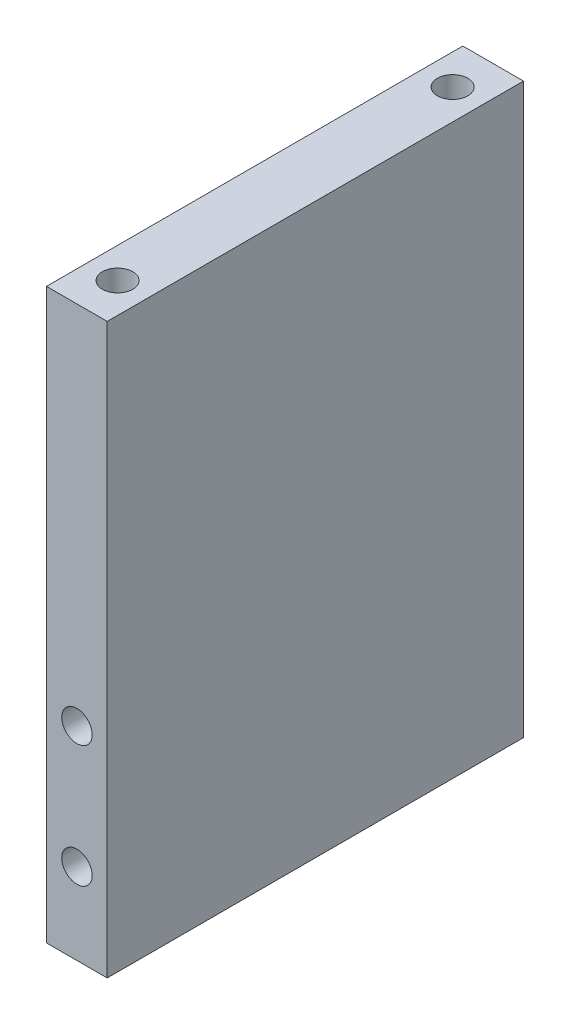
ISO-10303-21;
HEADER;
FILE_DESCRIPTION(('STEP AP214'),'2;1');
FILE_NAME('part.step','',(''),(''),'','','');
FILE_SCHEMA(('AUTOMOTIVE_DESIGN { 1 0 10303 214 1 1 1 1 }'));
ENDSEC;
DATA;
#1=APPLICATION_CONTEXT('core data for automotive mechanical design processes');
#2=APPLICATION_PROTOCOL_DEFINITION('international standard','automotive_design',2000,#1);
#3=PRODUCT_CONTEXT('',#1,'mechanical');
#4=PRODUCT('Part','Part','',(#3));
#5=PRODUCT_RELATED_PRODUCT_CATEGORY('part','',(#4));
#6=PRODUCT_DEFINITION_FORMATION('','',#4);
#7=PRODUCT_DEFINITION_CONTEXT('part definition',#1,'design');
#8=PRODUCT_DEFINITION('design','',#6,#7);
#9=PRODUCT_DEFINITION_SHAPE('','',#8);
#10=(LENGTH_UNIT() NAMED_UNIT(*) SI_UNIT(.MILLI.,.METRE.));
#11=(NAMED_UNIT(*) PLANE_ANGLE_UNIT() SI_UNIT($,.RADIAN.));
#12=(NAMED_UNIT(*) SI_UNIT($,.STERADIAN.) SOLID_ANGLE_UNIT());
#13=UNCERTAINTY_MEASURE_WITH_UNIT(LENGTH_MEASURE(1.E-05),#10,'distance_accuracy_value','');
#14=(GEOMETRIC_REPRESENTATION_CONTEXT(3) GLOBAL_UNCERTAINTY_ASSIGNED_CONTEXT((#13)) GLOBAL_UNIT_ASSIGNED_CONTEXT((#10,
#11,#12)) REPRESENTATION_CONTEXT('',''));
#15=CARTESIAN_POINT('',(0.,0.,0.));
#16=DIRECTION('',(0.,0.,1.));
#17=DIRECTION('',(1.,0.,0.));
#18=AXIS2_PLACEMENT_3D('',#15,#16,#17);
#19=CARTESIAN_POINT('',(0.,56.,0.));
#20=DIRECTION('',(0.,1.,0.));
#21=DIRECTION('',(0.,0.,1.));
#22=AXIS2_PLACEMENT_3D('',#19,#20,#21);
#23=PLANE('',#22);
#24=CARTESIAN_POINT('',(0.00999999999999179,56.,16.5));
#25=DIRECTION('',(0.,1.,0.));
#26=DIRECTION('',(0.,0.,1.));
#27=AXIS2_PLACEMENT_3D('',#24,#25,#26);
#28=CIRCLE('',#27,1.5);
#29=CARTESIAN_POINT('',(0.00999999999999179,56.,18.));
#30=VERTEX_POINT('',#29);
#31=EDGE_CURVE('E152',#30,#30,#28,.F.);
#32=ORIENTED_EDGE('',*,*,#31,.T.);
#33=EDGE_LOOP('',(#32));
#34=FACE_BOUND('',#33,.T.);
#35=DIRECTION('',(0.,0.,-1.));
#36=VECTOR('',#35,1.);
#37=CARTESIAN_POINT('',(-2.99,56.,0.));
#38=LINE('',#37,#36);
#39=CARTESIAN_POINT('',(-2.99,56.,20.5));
#40=VERTEX_POINT('',#39);
#41=CARTESIAN_POINT('',(-2.99,56.,-20.5));
#42=VERTEX_POINT('',#41);
#43=EDGE_CURVE('E120',#40,#42,#38,.T.);
#44=ORIENTED_EDGE('',*,*,#43,.F.);
#45=DIRECTION('',(1.,0.,0.));
#46=VECTOR('',#45,1.);
#47=CARTESIAN_POINT('',(0.,56.,20.5));
#48=LINE('',#47,#46);
#49=CARTESIAN_POINT('',(2.99,56.,20.5));
#50=VERTEX_POINT('',#49);
#51=EDGE_CURVE('E116',#40,#50,#48,.T.);
#52=ORIENTED_EDGE('',*,*,#51,.T.);
#53=DIRECTION('',(0.,0.,-1.));
#54=VECTOR('',#53,1.);
#55=CARTESIAN_POINT('',(2.99,56.,0.));
#56=LINE('',#55,#54);
#57=CARTESIAN_POINT('',(2.99,56.,-20.5));
#58=VERTEX_POINT('',#57);
#59=EDGE_CURVE('E108',#50,#58,#56,.T.);
#60=ORIENTED_EDGE('',*,*,#59,.T.);
#61=DIRECTION('',(1.,0.,0.));
#62=VECTOR('',#61,1.);
#63=CARTESIAN_POINT('',(0.,56.,-20.5));
#64=LINE('',#63,#62);
#65=EDGE_CURVE('E115',#42,#58,#64,.T.);
#66=ORIENTED_EDGE('',*,*,#65,.F.);
#67=EDGE_LOOP('',(#44,#52,#60,#66));
#68=FACE_BOUND('',#67,.T.);
#69=CARTESIAN_POINT('',(0.00999999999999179,56.,-16.5));
#70=DIRECTION('',(0.,1.,0.));
#71=DIRECTION('',(0.,0.,1.));
#72=AXIS2_PLACEMENT_3D('',#69,#70,#71);
#73=CIRCLE('',#72,1.5);
#74=CARTESIAN_POINT('',(0.00999999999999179,56.,-15.));
#75=VERTEX_POINT('',#74);
#76=EDGE_CURVE('E159',#75,#75,#73,.T.);
#77=ORIENTED_EDGE('',*,*,#76,.F.);
#78=EDGE_LOOP('',(#77));
#79=FACE_BOUND('',#78,.T.);
#80=ADVANCED_FACE('F65',(#34,#68,#79),#23,.T.);
#81=CARTESIAN_POINT('',(0.,0.,0.));
#82=DIRECTION('',(0.,1.,0.));
#83=DIRECTION('',(0.,0.,1.));
#84=AXIS2_PLACEMENT_3D('',#81,#82,#83);
#85=PLANE('',#84);
#86=CARTESIAN_POINT('',(0.00999999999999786,0.,16.5));
#87=DIRECTION('',(0.,1.,0.));
#88=DIRECTION('',(0.,0.,1.));
#89=AXIS2_PLACEMENT_3D('',#86,#87,#88);
#90=CIRCLE('',#89,1.5);
#91=CARTESIAN_POINT('',(0.00999999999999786,0.,18.));
#92=VERTEX_POINT('',#91);
#93=EDGE_CURVE('E140',#92,#92,#90,.F.);
#94=ORIENTED_EDGE('',*,*,#93,.F.);
#95=EDGE_LOOP('',(#94));
#96=FACE_BOUND('',#95,.T.);
#97=DIRECTION('',(0.,0.,-1.));
#98=VECTOR('',#97,1.);
#99=CARTESIAN_POINT('',(-2.99,0.,0.));
#100=LINE('',#99,#98);
#101=CARTESIAN_POINT('',(-2.99,0.,20.5));
#102=VERTEX_POINT('',#101);
#103=CARTESIAN_POINT('',(-2.99,0.,-20.5));
#104=VERTEX_POINT('',#103);
#105=EDGE_CURVE('E135',#102,#104,#100,.T.);
#106=ORIENTED_EDGE('',*,*,#105,.T.);
#107=DIRECTION('',(1.,0.,0.));
#108=VECTOR('',#107,1.);
#109=CARTESIAN_POINT('',(0.,0.,-20.5));
#110=LINE('',#109,#108);
#111=CARTESIAN_POINT('',(2.99,0.,-20.5));
#112=VERTEX_POINT('',#111);
#113=EDGE_CURVE('E129',#104,#112,#110,.T.);
#114=ORIENTED_EDGE('',*,*,#113,.T.);
#115=DIRECTION('',(0.,0.,-1.));
#116=VECTOR('',#115,1.);
#117=CARTESIAN_POINT('',(2.99,0.,0.));
#118=LINE('',#117,#116);
#119=CARTESIAN_POINT('',(2.99,0.,20.5));
#120=VERTEX_POINT('',#119);
#121=EDGE_CURVE('E132',#120,#112,#118,.T.);
#122=ORIENTED_EDGE('',*,*,#121,.F.);
#123=DIRECTION('',(1.,0.,0.));
#124=VECTOR('',#123,1.);
#125=CARTESIAN_POINT('',(0.,0.,20.5));
#126=LINE('',#125,#124);
#127=EDGE_CURVE('E125',#102,#120,#126,.T.);
#128=ORIENTED_EDGE('',*,*,#127,.F.);
#129=EDGE_LOOP('',(#106,#114,#122,#128));
#130=FACE_BOUND('',#129,.T.);
#131=CARTESIAN_POINT('',(0.00999999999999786,0.,-16.5));
#132=DIRECTION('',(0.,1.,0.));
#133=DIRECTION('',(0.,0.,1.));
#134=AXIS2_PLACEMENT_3D('',#131,#132,#133);
#135=CIRCLE('',#134,1.5);
#136=CARTESIAN_POINT('',(0.00999999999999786,0.,-15.));
#137=VERTEX_POINT('',#136);
#138=EDGE_CURVE('E147',#137,#137,#135,.T.);
#139=ORIENTED_EDGE('',*,*,#138,.T.);
#140=EDGE_LOOP('',(#139));
#141=FACE_BOUND('',#140,.T.);
#142=ADVANCED_FACE('F185',(#96,#130,#141),#85,.F.);
#143=CARTESIAN_POINT('',(0.,56.,20.5));
#144=DIRECTION('',(0.,0.,-1.));
#145=DIRECTION('',(-1.,0.,0.));
#146=AXIS2_PLACEMENT_3D('',#143,#144,#145);
#147=PLANE('',#146);
#148=CARTESIAN_POINT('',(0.00999999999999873,8.,20.5));
#149=DIRECTION('',(0.,0.,-1.));
#150=DIRECTION('',(-1.,0.,0.));
#151=AXIS2_PLACEMENT_3D('',#148,#149,#150);
#152=CIRCLE('',#151,1.5);
#153=CARTESIAN_POINT('',(-1.49,8.,20.5));
#154=VERTEX_POINT('',#153);
#155=EDGE_CURVE('E156',#154,#154,#152,.T.);
#156=ORIENTED_EDGE('',*,*,#155,.T.);
#157=EDGE_LOOP('',(#156));
#158=FACE_BOUND('',#157,.T.);
#159=CARTESIAN_POINT('',(0.00999999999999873,20.,20.5));
#160=DIRECTION('',(0.,0.,-1.));
#161=DIRECTION('',(-1.,0.,0.));
#162=AXIS2_PLACEMENT_3D('',#159,#160,#161);
#163=CIRCLE('',#162,1.5);
#164=CARTESIAN_POINT('',(-1.49,20.,20.5));
#165=VERTEX_POINT('',#164);
#166=EDGE_CURVE('E166',#165,#165,#163,.T.);
#167=ORIENTED_EDGE('',*,*,#166,.T.);
#168=EDGE_LOOP('',(#167));
#169=FACE_BOUND('',#168,.T.);
#170=ORIENTED_EDGE('',*,*,#127,.T.);
#171=DIRECTION('',(0.,-1.,0.));
#172=VECTOR('',#171,1.);
#173=CARTESIAN_POINT('',(2.99,56.,20.5));
#174=LINE('',#173,#172);
#175=EDGE_CURVE('E74',#50,#120,#174,.T.);
#176=ORIENTED_EDGE('',*,*,#175,.F.);
#177=ORIENTED_EDGE('',*,*,#51,.F.);
#178=DIRECTION('',(0.,-1.,0.));
#179=VECTOR('',#178,1.);
#180=CARTESIAN_POINT('',(-2.99,56.,20.5));
#181=LINE('',#180,#179);
#182=EDGE_CURVE('E12',#40,#102,#181,.T.);
#183=ORIENTED_EDGE('',*,*,#182,.T.);
#184=EDGE_LOOP('',(#170,#176,#177,#183));
#185=FACE_BOUND('',#184,.T.);
#186=ADVANCED_FACE('F123',(#158,#169,#185),#147,.F.);
#187=CARTESIAN_POINT('',(2.99,56.,0.));
#188=DIRECTION('',(-1.,0.,0.));
#189=DIRECTION('',(0.,0.,1.));
#190=AXIS2_PLACEMENT_3D('',#187,#188,#189);
#191=PLANE('',#190);
#192=ORIENTED_EDGE('',*,*,#121,.T.);
#193=DIRECTION('',(0.,-1.,0.));
#194=VECTOR('',#193,1.);
#195=CARTESIAN_POINT('',(2.99,56.,-20.5));
#196=LINE('',#195,#194);
#197=EDGE_CURVE('E96',#58,#112,#196,.T.);
#198=ORIENTED_EDGE('',*,*,#197,.F.);
#199=ORIENTED_EDGE('',*,*,#59,.F.);
#200=ORIENTED_EDGE('',*,*,#175,.T.);
#201=EDGE_LOOP('',(#192,#198,#199,#200));
#202=FACE_BOUND('',#201,.T.);
#203=ADVANCED_FACE('F110',(#202),#191,.F.);
#204=CARTESIAN_POINT('',(0.,56.,-20.5));
#205=DIRECTION('',(0.,0.,-1.));
#206=DIRECTION('',(-1.,0.,0.));
#207=AXIS2_PLACEMENT_3D('',#204,#205,#206);
#208=PLANE('',#207);
#209=CARTESIAN_POINT('',(0.00999999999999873,8.,-20.5));
#210=DIRECTION('',(0.,0.,-1.));
#211=DIRECTION('',(-1.,0.,0.));
#212=AXIS2_PLACEMENT_3D('',#209,#210,#211);
#213=CIRCLE('',#212,1.5);
#214=CARTESIAN_POINT('',(-1.49,8.,-20.5));
#215=VERTEX_POINT('',#214);
#216=EDGE_CURVE('E169',#215,#215,#213,.T.);
#217=ORIENTED_EDGE('',*,*,#216,.F.);
#218=EDGE_LOOP('',(#217));
#219=FACE_BOUND('',#218,.T.);
#220=CARTESIAN_POINT('',(0.00999999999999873,20.,-20.5));
#221=DIRECTION('',(0.,0.,-1.));
#222=DIRECTION('',(-1.,0.,0.));
#223=AXIS2_PLACEMENT_3D('',#220,#221,#222);
#224=CIRCLE('',#223,1.5);
#225=CARTESIAN_POINT('',(-1.49,20.,-20.5));
#226=VERTEX_POINT('',#225);
#227=EDGE_CURVE('E170',#226,#226,#224,.T.);
#228=ORIENTED_EDGE('',*,*,#227,.F.);
#229=EDGE_LOOP('',(#228));
#230=FACE_BOUND('',#229,.T.);
#231=ORIENTED_EDGE('',*,*,#113,.F.);
#232=DIRECTION('',(0.,-1.,0.));
#233=VECTOR('',#232,1.);
#234=CARTESIAN_POINT('',(-2.99,56.,-20.5));
#235=LINE('',#234,#233);
#236=EDGE_CURVE('E82',#42,#104,#235,.T.);
#237=ORIENTED_EDGE('',*,*,#236,.F.);
#238=ORIENTED_EDGE('',*,*,#65,.T.);
#239=ORIENTED_EDGE('',*,*,#197,.T.);
#240=EDGE_LOOP('',(#231,#237,#238,#239));
#241=FACE_BOUND('',#240,.T.);
#242=ADVANCED_FACE('F179',(#219,#230,#241),#208,.T.);
#243=CARTESIAN_POINT('',(-2.99,56.,0.));
#244=DIRECTION('',(-1.,0.,0.));
#245=DIRECTION('',(0.,0.,1.));
#246=AXIS2_PLACEMENT_3D('',#243,#244,#245);
#247=PLANE('',#246);
#248=ORIENTED_EDGE('',*,*,#105,.F.);
#249=ORIENTED_EDGE('',*,*,#182,.F.);
#250=ORIENTED_EDGE('',*,*,#43,.T.);
#251=ORIENTED_EDGE('',*,*,#236,.T.);
#252=EDGE_LOOP('',(#248,#249,#250,#251));
#253=FACE_BOUND('',#252,.T.);
#254=ADVANCED_FACE('F67',(#253),#247,.T.);
#255=CARTESIAN_POINT('',(0.00999999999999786,6.,16.5));
#256=DIRECTION('',(0.,-1.,0.));
#257=DIRECTION('',(0.,0.,-1.));
#258=AXIS2_PLACEMENT_3D('',#255,#256,#257);
#259=CYLINDRICAL_SURFACE('',#258,1.5);
#260=CARTESIAN_POINT('',(0.00999999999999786,6.,16.5));
#261=DIRECTION('',(0.,1.,0.));
#262=DIRECTION('',(0.,0.,1.));
#263=AXIS2_PLACEMENT_3D('',#260,#261,#262);
#264=CIRCLE('',#263,1.5);
#265=CARTESIAN_POINT('',(0.00999999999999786,6.,18.));
#266=VERTEX_POINT('',#265);
#267=EDGE_CURVE('E143',#266,#266,#264,.F.);
#268=ORIENTED_EDGE('',*,*,#267,.F.);
#269=EDGE_LOOP('',(#268));
#270=FACE_BOUND('',#269,.T.);
#271=ORIENTED_EDGE('',*,*,#93,.T.);
#272=EDGE_LOOP('',(#271));
#273=FACE_BOUND('',#272,.T.);
#274=ADVANCED_FACE('F188',(#270,#273),#259,.F.);
#275=CARTESIAN_POINT('',(0.,6.,0.));
#276=DIRECTION('',(0.,1.,0.));
#277=DIRECTION('',(0.,0.,1.));
#278=AXIS2_PLACEMENT_3D('',#275,#276,#277);
#279=PLANE('',#278);
#280=ORIENTED_EDGE('',*,*,#267,.T.);
#281=EDGE_LOOP('',(#280));
#282=FACE_BOUND('',#281,.T.);
#283=ADVANCED_FACE('F192',(#282),#279,.F.);
#284=CARTESIAN_POINT('',(0.00999999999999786,6.,-16.5));
#285=DIRECTION('',(0.,-1.,0.));
#286=DIRECTION('',(0.,0.,-1.));
#287=AXIS2_PLACEMENT_3D('',#284,#285,#286);
#288=CYLINDRICAL_SURFACE('',#287,1.5);
#289=CARTESIAN_POINT('',(0.00999999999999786,6.,-16.5));
#290=DIRECTION('',(0.,1.,0.));
#291=DIRECTION('',(0.,0.,1.));
#292=AXIS2_PLACEMENT_3D('',#289,#290,#291);
#293=CIRCLE('',#292,1.5);
#294=CARTESIAN_POINT('',(0.00999999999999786,6.,-15.));
#295=VERTEX_POINT('',#294);
#296=EDGE_CURVE('E137',#295,#295,#293,.T.);
#297=ORIENTED_EDGE('',*,*,#296,.T.);
#298=EDGE_LOOP('',(#297));
#299=FACE_BOUND('',#298,.T.);
#300=ORIENTED_EDGE('',*,*,#138,.F.);
#301=EDGE_LOOP('',(#300));
#302=FACE_BOUND('',#301,.T.);
#303=ADVANCED_FACE('F242',(#299,#302),#288,.F.);
#304=CARTESIAN_POINT('',(0.,6.,0.));
#305=DIRECTION('',(0.,1.,0.));
#306=DIRECTION('',(0.,0.,1.));
#307=AXIS2_PLACEMENT_3D('',#304,#305,#306);
#308=PLANE('',#307);
#309=ORIENTED_EDGE('',*,*,#296,.F.);
#310=EDGE_LOOP('',(#309));
#311=FACE_BOUND('',#310,.T.);
#312=ADVANCED_FACE('F238',(#311),#308,.F.);
#313=CARTESIAN_POINT('',(0.00999999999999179,50.,16.5));
#314=DIRECTION('',(0.,1.,0.));
#315=DIRECTION('',(0.,0.,1.));
#316=AXIS2_PLACEMENT_3D('',#313,#314,#315);
#317=CYLINDRICAL_SURFACE('',#316,1.5);
#318=CARTESIAN_POINT('',(0.00999999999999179,50.,16.5));
#319=DIRECTION('',(0.,1.,0.));
#320=DIRECTION('',(0.,0.,1.));
#321=AXIS2_PLACEMENT_3D('',#318,#319,#320);
#322=CIRCLE('',#321,1.5);
#323=CARTESIAN_POINT('',(0.00999999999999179,50.,18.));
#324=VERTEX_POINT('',#323);
#325=EDGE_CURVE('E155',#324,#324,#322,.F.);
#326=ORIENTED_EDGE('',*,*,#325,.T.);
#327=EDGE_LOOP('',(#326));
#328=FACE_BOUND('',#327,.T.);
#329=ORIENTED_EDGE('',*,*,#31,.F.);
#330=EDGE_LOOP('',(#329));
#331=FACE_BOUND('',#330,.T.);
#332=ADVANCED_FACE('F234',(#328,#331),#317,.F.);
#333=CARTESIAN_POINT('',(0.,50.,0.));
#334=DIRECTION('',(0.,1.,0.));
#335=DIRECTION('',(0.,0.,1.));
#336=AXIS2_PLACEMENT_3D('',#333,#334,#335);
#337=PLANE('',#336);
#338=ORIENTED_EDGE('',*,*,#325,.F.);
#339=EDGE_LOOP('',(#338));
#340=FACE_BOUND('',#339,.T.);
#341=ADVANCED_FACE('F230',(#340),#337,.T.);
#342=CARTESIAN_POINT('',(0.00999999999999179,50.,-16.5));
#343=DIRECTION('',(0.,1.,0.));
#344=DIRECTION('',(0.,0.,1.));
#345=AXIS2_PLACEMENT_3D('',#342,#343,#344);
#346=CYLINDRICAL_SURFACE('',#345,1.5);
#347=CARTESIAN_POINT('',(0.00999999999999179,50.,-16.5));
#348=DIRECTION('',(0.,1.,0.));
#349=DIRECTION('',(0.,0.,1.));
#350=AXIS2_PLACEMENT_3D('',#347,#348,#349);
#351=CIRCLE('',#350,1.5);
#352=CARTESIAN_POINT('',(0.00999999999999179,50.,-15.));
#353=VERTEX_POINT('',#352);
#354=EDGE_CURVE('E144',#353,#353,#351,.T.);
#355=ORIENTED_EDGE('',*,*,#354,.F.);
#356=EDGE_LOOP('',(#355));
#357=FACE_BOUND('',#356,.T.);
#358=ORIENTED_EDGE('',*,*,#76,.T.);
#359=EDGE_LOOP('',(#358));
#360=FACE_BOUND('',#359,.T.);
#361=ADVANCED_FACE('F224',(#357,#360),#346,.F.);
#362=CARTESIAN_POINT('',(0.,50.,0.));
#363=DIRECTION('',(0.,1.,0.));
#364=DIRECTION('',(0.,0.,1.));
#365=AXIS2_PLACEMENT_3D('',#362,#363,#364);
#366=PLANE('',#365);
#367=ORIENTED_EDGE('',*,*,#354,.T.);
#368=EDGE_LOOP('',(#367));
#369=FACE_BOUND('',#368,.T.);
#370=ADVANCED_FACE('F216',(#369),#366,.T.);
#371=CARTESIAN_POINT('',(0.00999999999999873,20.,38.5));
#372=DIRECTION('',(0.,0.,-1.));
#373=DIRECTION('',(-1.,0.,0.));
#374=AXIS2_PLACEMENT_3D('',#371,#372,#373);
#375=CYLINDRICAL_SURFACE('',#374,1.5);
#376=ORIENTED_EDGE('',*,*,#227,.T.);
#377=EDGE_LOOP('',(#376));
#378=FACE_BOUND('',#377,.T.);
#379=ORIENTED_EDGE('',*,*,#166,.F.);
#380=EDGE_LOOP('',(#379));
#381=FACE_BOUND('',#380,.T.);
#382=ADVANCED_FACE('F214',(#378,#381),#375,.F.);
#383=CARTESIAN_POINT('',(0.00999999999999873,8.,38.5));
#384=DIRECTION('',(0.,0.,-1.));
#385=DIRECTION('',(-1.,0.,0.));
#386=AXIS2_PLACEMENT_3D('',#383,#384,#385);
#387=CYLINDRICAL_SURFACE('',#386,1.5);
#388=ORIENTED_EDGE('',*,*,#216,.T.);
#389=EDGE_LOOP('',(#388));
#390=FACE_BOUND('',#389,.T.);
#391=ORIENTED_EDGE('',*,*,#155,.F.);
#392=EDGE_LOOP('',(#391));
#393=FACE_BOUND('',#392,.T.);
#394=ADVANCED_FACE('F176',(#390,#393),#387,.F.);
#395=CLOSED_SHELL('',(#80,#142,#186,#203,#242,#254,#274,#283,#303,#312,#332,#341,#361,#370,#382,#394));
#396=MANIFOLD_SOLID_BREP('B2',#395);
#397=ADVANCED_BREP_SHAPE_REPRESENTATION('',(#18,#396),#14);
#398=SHAPE_DEFINITION_REPRESENTATION(#9,#397);
ENDSEC;
END-ISO-10303-21;
